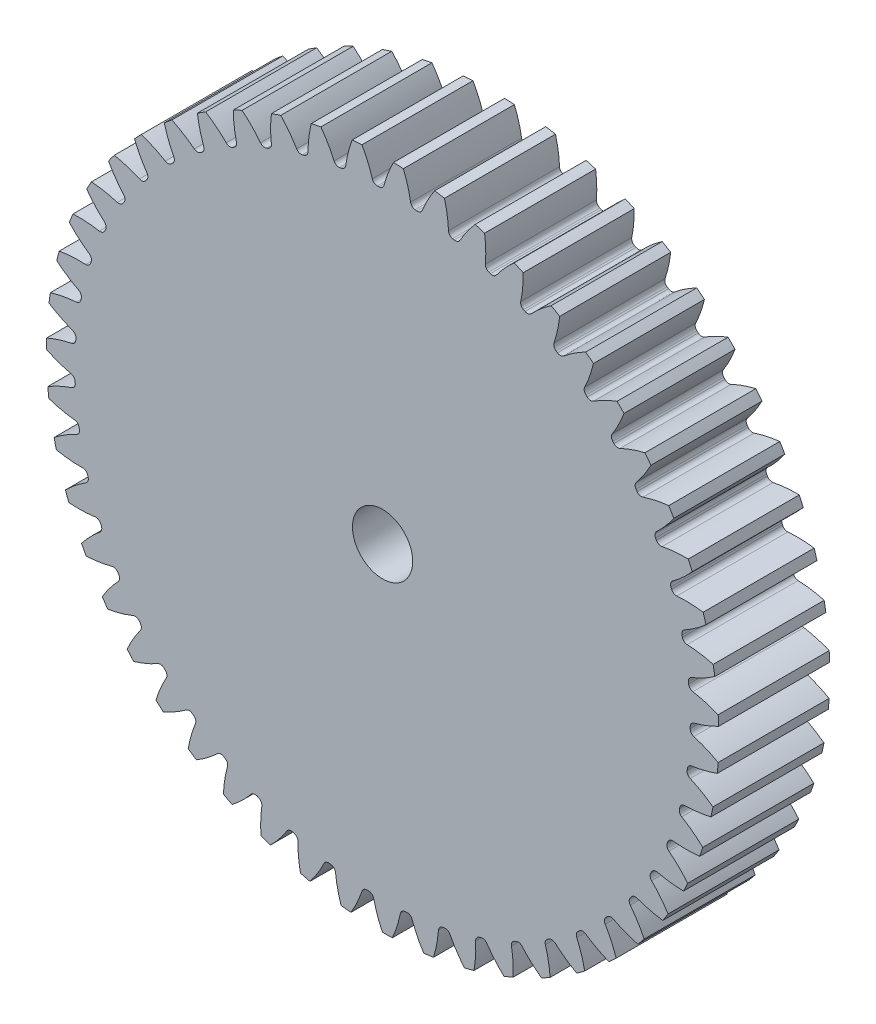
from build123d import *

# Parameters (mm, degrees)
SKETCH3_R         = 269.24
GEARBODY_DEPTH    = 88.9
TOOTHCUT_DEPTH    = 392.003280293
CIRPATTERN1_COUNT = 51
BOREDIA_R         = 24.13
BORE_DEPTH        = 12700


with BuildPart() as part:
    # Sketch3 → gearBody (new body)
    with BuildSketch(Plane.XY):
        Circle(SKETCH3_R)
    extrude(amount=GEARBODY_DEPTH)

    # Sketch2 → toothCut (cut, through all)
    with BuildSketch(Plane.XY):
        with BuildLine():
            ThreePointArc((246.333969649, -4.762331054), (246.346509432, -4.062227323), (246.35705946, -3.36209078))
            ThreePointArc((246.35705946, -3.36209078), (247.232265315, -0.873977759), (249.433586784, 0.578907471))
            ThreePointArc((249.433586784, 0.578907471), (259.550387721, 3.868196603), (269.24, 8.259153))
            ThreePointArc((269.24, 8.259153), (269.330033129, -4.441223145), (268.821307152, -17.131725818))
            ThreePointArc((268.821307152, -17.131725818), (259.281736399, -12.42368227), (249.278886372, -8.802622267))
            ThreePointArc((249.278886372, -8.802622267), (247.126664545, -7.277947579), (246.333969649, -4.762331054))
        make_face()
    toothcut = extrude(amount=TOOTHCUT_DEPTH, mode=Mode.SUBTRACT)

    # CirPattern1: toothCut ×51 about axis
    cirpattern1_axis = Axis((0, 0, 0), (0, 0, 1))
    for i in range(1, CIRPATTERN1_COUNT):
        add(toothcut.rotate(cirpattern1_axis, i * 360 / CIRPATTERN1_COUNT), mode=Mode.SUBTRACT)

    # boreDia → bore (cut, symmetric)
    with BuildSketch(Plane.XY):
        Circle(BOREDIA_R)
    extrude(amount=BORE_DEPTH, both=True, mode=Mode.SUBTRACT)


solid = part.part
